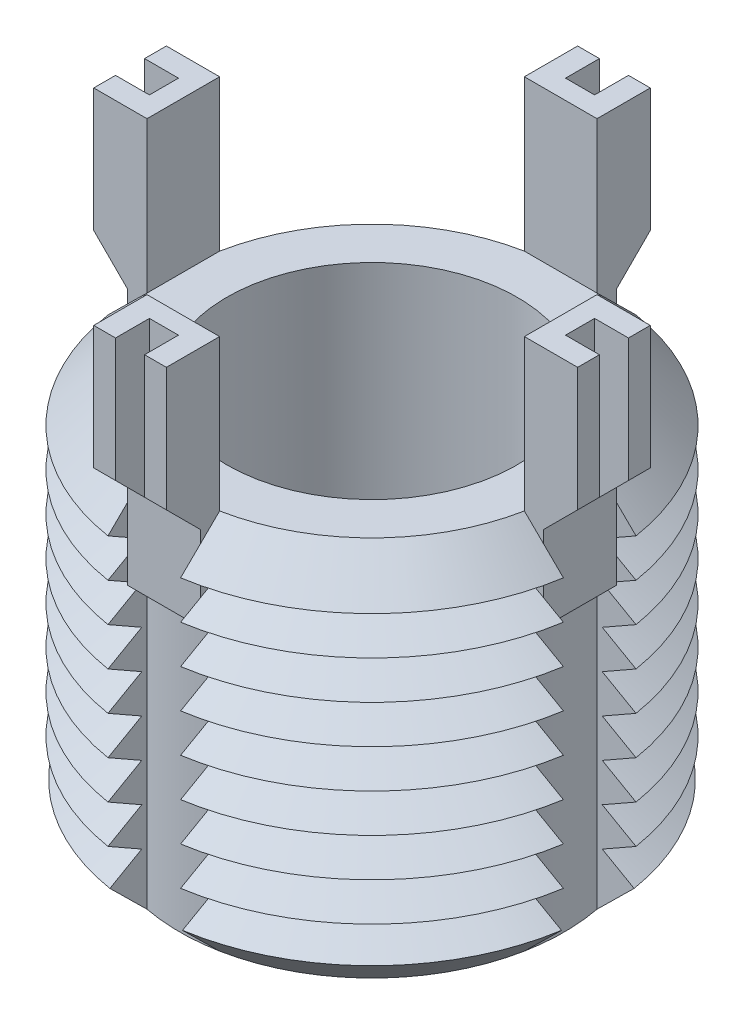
from build123d import *

# Parameters (mm, degrees)
SKETCH1_R           = 9.525
BOSS_EXTRUDE1_DEPTH = 15.748
CHAMFER1_SIZE       = 1.587
LPATTERN1_COUNT     = 8
LPATTERN1_PITCH     = 1.587
CUT_EXTRUDE1_REACH  = 22.723
CIRPATTERN1_COUNT   = 4
BOSS_EXTRUDE3_DEPTH = 1.5
CIRPATTERN2_COUNT   = 4
CUT_EXTRUDE3_REACH  = 28.139
SKETCH6_W           = 1.4
SKETCH6_H           = 1.2
SKETCH6_W_2         = 1.2
SKETCH6_H_2         = 1.4
SKETCH7_R           = 6
CUT_EXTRUDE4_DEPTH  = 15.748


with BuildPart() as part:
    # Sketch1 → Boss-Extrude1 (new body)
    with BuildSketch(Plane(origin=(0, 0, 0), x_dir=(1, 0, 0), z_dir=(0, 1, 0))):
        with Locations(Location((0, 0, 0), (0, 0, 270))):
            Circle(SKETCH1_R)
    extrude(amount=-BOSS_EXTRUDE1_DEPTH)

    # Chamfer1
    chamfer1_edges = [part.edges().sort_by_distance(p)[0] for p in [
        (0, 0, -9.525),
        (0, -15.748, -9.525),
    ]]
    chamfer(chamfer1_edges, length=CHAMFER1_SIZE)

    # Sketch3 → Cut-Revolve1 (revolve, cut)
    with BuildSketch(Plane(origin=(0, 0, 0), x_dir=(0, 0, -1), z_dir=(1, 0, 0))):
        Polygon((-9.525, -1.587), (-8.150617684, -2.3805), (-9.525, -3.174), align=None)
    cut_revolve1 = revolve(axis=Axis((0, 0.885892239, 0), (0, -1, 0)), mode=Mode.SUBTRACT)

    # LPattern1: Cut-Revolve1 ×8
    with Locations(*[(0, -i * LPATTERN1_PITCH, 0) for i in range(1, LPATTERN1_COUNT)]):
        add(cut_revolve1, mode=Mode.SUBTRACT)

    # Cut-Extrude1: up to this cone (the profile starts inside it)
    cut_extrude1_end = Plane(origin=(0, 0, 0), z_dir=(0, 1, 0)).offset(-23.685999) * Cone(1e-06, 70.595, 70.594999, align=(Align.CENTER, Align.CENTER, Align.MIN), mode=Mode.PRIVATE)
    # Sketch4 → Cut-Extrude1 (cut, up to the surface)
    with BuildSketch(Plane(origin=(0, 0, 0), x_dir=(1, 0, 0), z_dir=(0, 1, 0)), mode=Mode.PRIVATE) as cut_extrude1_sk1:
        with BuildLine():
            Line((-7.79498839, 1.5), (-9.406148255, 1.5))
            ThreePointArc((-9.406148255, 1.5), (-9.525, 0), (-9.406148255, -1.5))
            Line((-9.406148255, -1.5), (-7.79498839, -1.5))
            ThreePointArc((-7.79498839, -1.5), (-7.938, 0), (-7.79498839, 1.5))
        make_face()
    cut_extrude1_tool1 = extrude(cut_extrude1_sk1.sketch, amount=-CUT_EXTRUDE1_REACH, mode=Mode.PRIVATE) & cut_extrude1_end
    cut_extrude1 = cut_extrude1_tool1.solids().sort_by_distance((-8.687817, 0, 0))[0]
    add(cut_extrude1, mode=Mode.SUBTRACT)

    # CirPattern1: Cut-Extrude1 ×4 about axis
    cirpattern1_axis = Axis((0, 0, 0), (0, 1, 0))
    for i in range(1, CIRPATTERN1_COUNT):
        add(cut_extrude1.rotate(cirpattern1_axis, i * 360 / CIRPATTERN1_COUNT), mode=Mode.SUBTRACT)

    # Sketch5 → Boss-Extrude3 (add, symmetric)
    with BuildSketch(Plane(origin=(0, 0, 0), x_dir=(0, 0, -1), z_dir=(1, 0, 0))):
        Polygon((-7.79498839, 6.239), (-7.79498839, -3.761), (-8.59498839, -3.761), (-8.59498839, -0.261), (-9.99498839, 1.139), (-9.99498839, 6.239), align=None)
    boss_extrude3 = extrude(amount=BOSS_EXTRUDE3_DEPTH, both=True)

    # CirPattern2: Boss-Extrude3 ×4 about axis
    cirpattern2_axis = Axis((0, 0, 0), (0, 1, 0))
    for i in range(1, CIRPATTERN2_COUNT):
        add(boss_extrude3.rotate(cirpattern2_axis, i * 360 / CIRPATTERN2_COUNT))

    # Cut-Extrude3: up to this plane
    cut_extrude3_end = Plane(origin=(-8.59498839, -0.261, 1.5), z_dir=(0.7071067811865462, 0.7071067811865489, -7.406550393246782e-15))
    # Sketch6 → Cut-Extrude3 (cut, up to the surface)
    with BuildSketch(Plane(origin=(0, 6.239, 0), x_dir=(1, 0, 0), z_dir=(0, 1, 0)), mode=Mode.PRIVATE) as cut_extrude3_sk1:
        with Locations((-9.29498839, 0)):
            Rectangle(SKETCH6_W, SKETCH6_H)
    cut_extrude3_tool1 = split(extrude(cut_extrude3_sk1.sketch, amount=-CUT_EXTRUDE3_REACH, mode=Mode.PRIVATE), bisect_by=cut_extrude3_end, keep=Keep.BOTH, mode=Mode.PRIVATE)
    add(cut_extrude3_tool1.solids().sort_by_distance((-9.294988, 6.239, 0))[0], mode=Mode.SUBTRACT)
    # Sketch6 → Cut-Extrude3 (cut, up to the surface)
    with BuildSketch(Plane(origin=(0, 6.239, 0), x_dir=(1, 0, 0), z_dir=(0, 1, 0)), mode=Mode.PRIVATE) as cut_extrude3_sk2:
        with Locations((0, 9.29498839)):
            Rectangle(SKETCH6_W_2, SKETCH6_H_2)
    cut_extrude3_tool2 = split(extrude(cut_extrude3_sk2.sketch, amount=-CUT_EXTRUDE3_REACH, mode=Mode.PRIVATE), bisect_by=cut_extrude3_end, keep=Keep.BOTH, mode=Mode.PRIVATE)
    add(cut_extrude3_tool2.solids().sort_by_distance((0, 6.239, -9.294988))[0], mode=Mode.SUBTRACT)
    # Sketch6 → Cut-Extrude3 (cut, up to the surface)
    with BuildSketch(Plane(origin=(0, 6.239, 0), x_dir=(1, 0, 0), z_dir=(0, 1, 0)), mode=Mode.PRIVATE) as cut_extrude3_sk3:
        with Locations((9.29498839, 0)):
            Rectangle(SKETCH6_W, SKETCH6_H)
    cut_extrude3_tool3 = split(extrude(cut_extrude3_sk3.sketch, amount=-CUT_EXTRUDE3_REACH, mode=Mode.PRIVATE), bisect_by=cut_extrude3_end, keep=Keep.BOTH, mode=Mode.PRIVATE)
    add(cut_extrude3_tool3.solids().sort_by_distance((9.294988, 6.239, 0))[0], mode=Mode.SUBTRACT)
    # Sketch6 → Cut-Extrude3 (cut, up to the surface)
    with BuildSketch(Plane(origin=(0, 6.239, 0), x_dir=(1, 0, 0), z_dir=(0, 1, 0)), mode=Mode.PRIVATE) as cut_extrude3_sk4:
        with Locations((0, -9.29498839)):
            Rectangle(SKETCH6_W_2, SKETCH6_H_2)
    cut_extrude3_tool4 = split(extrude(cut_extrude3_sk4.sketch, amount=-CUT_EXTRUDE3_REACH, mode=Mode.PRIVATE), bisect_by=cut_extrude3_end, keep=Keep.BOTH, mode=Mode.PRIVATE)
    add(cut_extrude3_tool4.solids().sort_by_distance((0, 6.239, 9.294988))[0], mode=Mode.SUBTRACT)

    # Sketch7 → Cut-Extrude4 (cut)
    with BuildSketch(Plane(origin=(0, 0, 0), x_dir=(1, 0, 0), z_dir=(0, 1, 0))):
        with Locations(Location((0, 0, 0), (0, 0, 270))):
            Circle(SKETCH7_R)
    extrude(amount=-CUT_EXTRUDE4_DEPTH, mode=Mode.SUBTRACT)


solid = part.part
